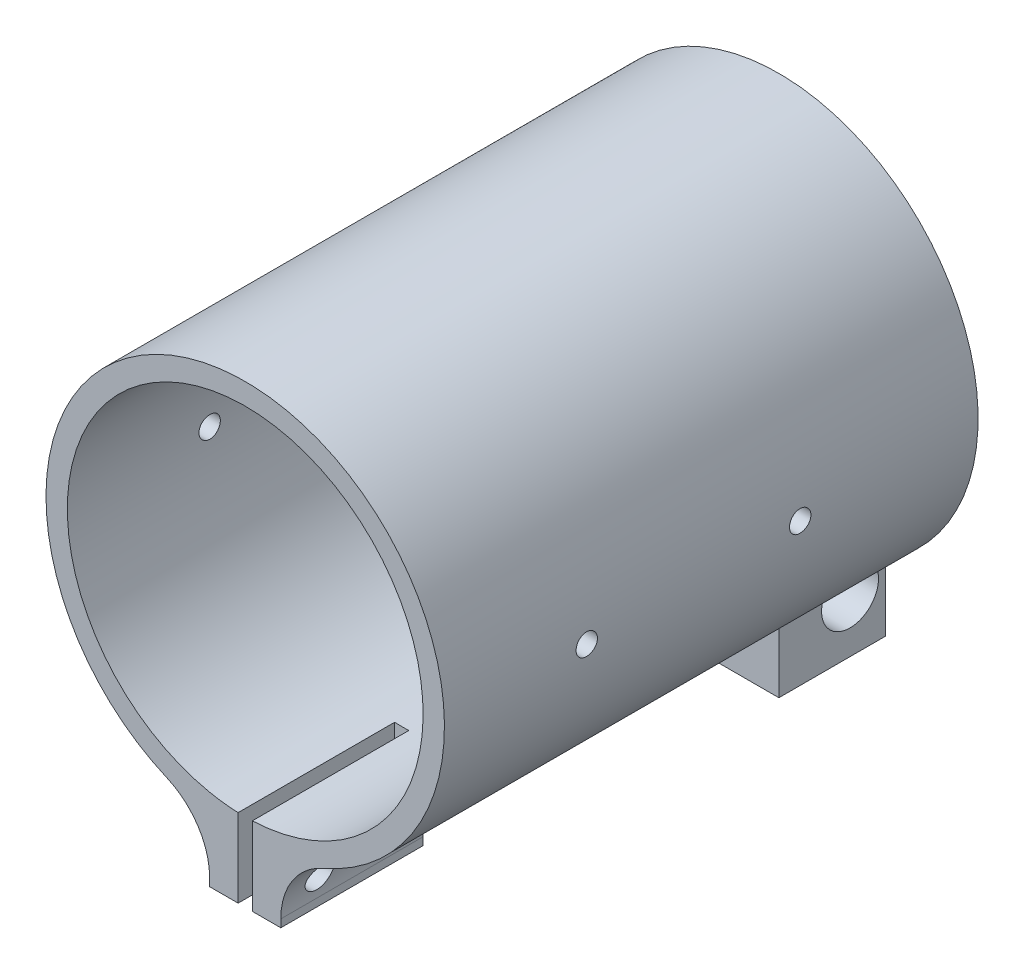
from build123d import *

# Parameters (mm, degrees)
SKETCH_1_R               = 28
SKETCH_1_R_2             = 25
EXTRUDE_1_DEPTH          = 75
EXTRUDE_START            = -20
EXTRUDE_3_DEPTH          = 20
FILLET_1_R               = 10
SKETCH_3_W               = 2
SKETCH_3_H               = 33.376102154
CUT_EXTRUDE_1_DEPTH      = 22
CUT_EXTRUDE_2_DEPTH      = 88.778129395
CUT_EXTRUDE_2_DEPTH_BACK = 88.778129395
SKETCH_4_R               = 2
SKETCH_4_R_2             = 1.5
SKETCH_6_W               = 15
SKETCH_6_H               = 15
SKETCH_6_R               = 4
SKETCH_6_W_2             = 5
SKETCH_6_H_2             = 5
EXTRUDE_4_DEPTH          = 5


with BuildPart() as part:
    # Sketch 1 → Extrude 1 (new body)
    with BuildSketch(Plane.XY):
        Circle(SKETCH_1_R)
        Circle(SKETCH_1_R_2, mode=Mode.SUBTRACT)
    extrude(amount=EXTRUDE_1_DEPTH)

    # Sketch 2 → Extrude 3 (add)
    with BuildSketch(Plane.XY.offset(75).offset(EXTRUDE_START)):
        with BuildLine():
            Line((5, -36), (5, -27.549954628))
            ThreePointArc((5, -27.549954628), (0, -28), (-5, -27.549954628))
            Line((-5, -27.549954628), (-5, -36))
            Line((-5, -36), (5, -36))
        make_face()
    extrude(amount=EXTRUDE_3_DEPTH)

    # Fillet 1
    fillet_1_edges = [part.edges().sort_by_distance(p)[0] for p in [
        (-5, -27.549954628, 65),
        (5, -27.549954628, 65),
    ]]
    fillet(fillet_1_edges, radius=FILLET_1_R)

    # Sketch 3 → Cut-Extrude 1 (cut)
    with BuildSketch(Plane.XY.offset(75)):
        with Locations((0, -22.764444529)):
            Rectangle(SKETCH_3_W, SKETCH_3_H)
    extrude(amount=-CUT_EXTRUDE_1_DEPTH, mode=Mode.SUBTRACT)

    # Sketch 4 → Cut-Extrude 2 (cut, two sides: drawn at the far end of the back side and taken through both)
    with BuildSketch(Plane(origin=(0, 0, 0), x_dir=(0, 0, -1), z_dir=(1, 0, 0)).offset(-CUT_EXTRUDE_2_DEPTH_BACK)):
        with Locations((-70, -31.824089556)):
            Circle(SKETCH_4_R)
        with Locations((-60.000009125, -31.837598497)):
            Circle(SKETCH_4_R)
        with Locations((-55, 0)):
            Circle(SKETCH_4_R_2)
        with Locations((-25, 0)):
            Circle(SKETCH_4_R_2)
    extrude(amount=CUT_EXTRUDE_2_DEPTH + CUT_EXTRUDE_2_DEPTH_BACK, mode=Mode.SUBTRACT)

    # Sketch 6 → Extrude 4 (add, symmetric)
    # profile 1 of 2: a face of its own
    with BuildSketch(Plane(origin=(0, 0, 0), x_dir=(0, 0, -1), z_dir=(1, 0, 0))):
        with Locations((2.5, -35.5)):
            Rectangle(SKETCH_6_W, SKETCH_6_H)
        with Locations((5, -35.5)):
            Circle(SKETCH_6_R, mode=Mode.SUBTRACT)
    # profile 2 of 2: a face of its own
    with BuildSketch(Plane(origin=(0, 0, 0), x_dir=(0, 0, -1), z_dir=(1, 0, 0))):
        with Locations((-2.5, -25.5)):
            Rectangle(SKETCH_6_W_2, SKETCH_6_H_2)
    extrude(amount=EXTRUDE_4_DEPTH, both=True)


solid = part.part
